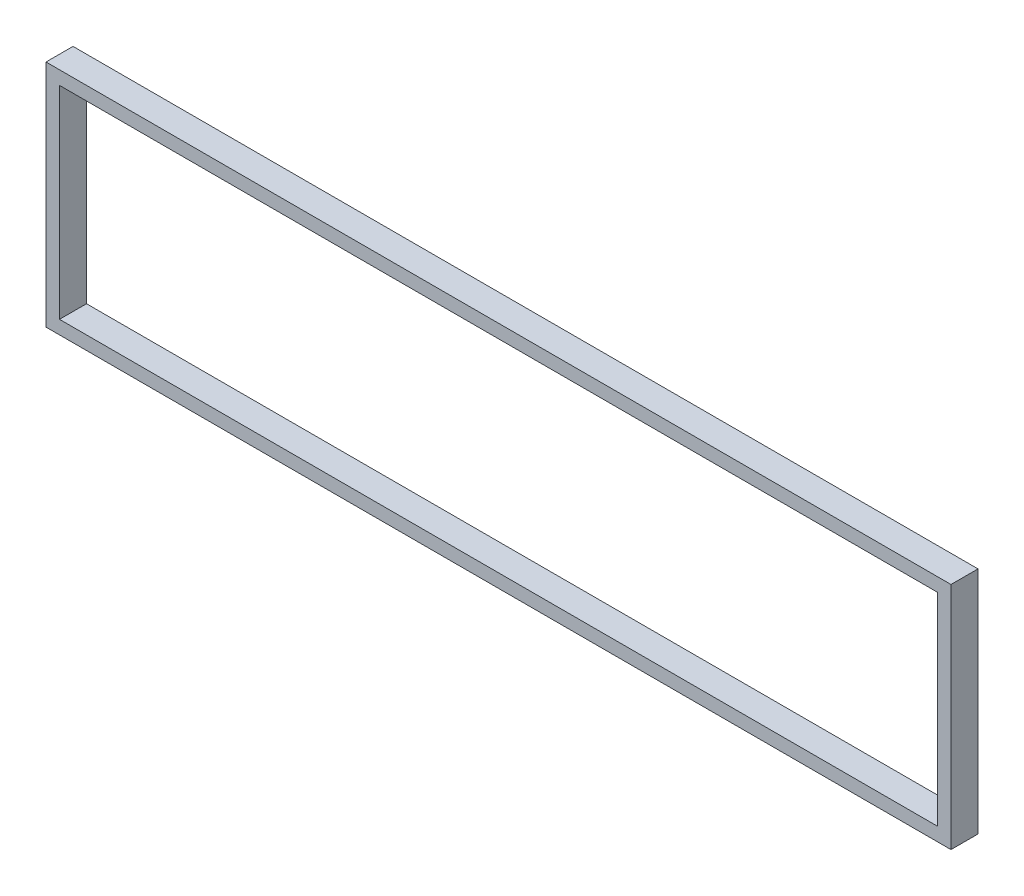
ISO-10303-21;
HEADER;
FILE_DESCRIPTION(('STEP AP214'),'2;1');
FILE_NAME('part.step','',(''),(''),'','','');
FILE_SCHEMA(('AUTOMOTIVE_DESIGN { 1 0 10303 214 1 1 1 1 }'));
ENDSEC;
DATA;
#1=APPLICATION_CONTEXT('core data for automotive mechanical design processes');
#2=APPLICATION_PROTOCOL_DEFINITION('international standard','automotive_design',2000,#1);
#3=PRODUCT_CONTEXT('',#1,'mechanical');
#4=PRODUCT('Part','Part','',(#3));
#5=PRODUCT_RELATED_PRODUCT_CATEGORY('part','',(#4));
#6=PRODUCT_DEFINITION_FORMATION('','',#4);
#7=PRODUCT_DEFINITION_CONTEXT('part definition',#1,'design');
#8=PRODUCT_DEFINITION('design','',#6,#7);
#9=PRODUCT_DEFINITION_SHAPE('','',#8);
#10=(LENGTH_UNIT() NAMED_UNIT(*) SI_UNIT(.MILLI.,.METRE.));
#11=(NAMED_UNIT(*) PLANE_ANGLE_UNIT() SI_UNIT($,.RADIAN.));
#12=(NAMED_UNIT(*) SI_UNIT($,.STERADIAN.) SOLID_ANGLE_UNIT());
#13=UNCERTAINTY_MEASURE_WITH_UNIT(LENGTH_MEASURE(1.E-05),#10,'distance_accuracy_value','');
#14=(GEOMETRIC_REPRESENTATION_CONTEXT(3) GLOBAL_UNCERTAINTY_ASSIGNED_CONTEXT((#13)) GLOBAL_UNIT_ASSIGNED_CONTEXT((#10,
#11,#12)) REPRESENTATION_CONTEXT('',''));
#15=CARTESIAN_POINT('',(0.,0.,0.));
#16=DIRECTION('',(0.,0.,1.));
#17=DIRECTION('',(1.,0.,0.));
#18=AXIS2_PLACEMENT_3D('',#15,#16,#17);
#19=CARTESIAN_POINT('',(-54509.9999999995,-10.0000000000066,10.));
#20=DIRECTION('',(0.,0.,1.));
#21=DIRECTION('',(1.,0.,0.));
#22=AXIS2_PLACEMENT_3D('',#19,#20,#21);
#23=PLANE('',#22);
#24=DIRECTION('',(0.,-1.,0.));
#25=VECTOR('',#24,1.);
#26=CARTESIAN_POINT('',(-54509.9999999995,159.999999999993,10.));
#27=LINE('',#26,#25);
#28=CARTESIAN_POINT('',(-54509.9999999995,159.999999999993,10.));
#29=VERTEX_POINT('',#28);
#30=CARTESIAN_POINT('',(-54509.9999999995,-10.0000000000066,10.));
#31=VERTEX_POINT('',#30);
#32=EDGE_CURVE('E137',#29,#31,#27,.T.);
#33=ORIENTED_EDGE('',*,*,#32,.T.);
#34=DIRECTION('',(1.,0.,0.));
#35=VECTOR('',#34,1.);
#36=CARTESIAN_POINT('',(-54509.9999999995,-10.0000000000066,10.));
#37=LINE('',#36,#35);
#38=CARTESIAN_POINT('',(-53839.9999999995,-10.0000000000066,10.));
#39=VERTEX_POINT('',#38);
#40=EDGE_CURVE('E140',#31,#39,#37,.T.);
#41=ORIENTED_EDGE('',*,*,#40,.T.);
#42=DIRECTION('',(0.,1.,0.));
#43=VECTOR('',#42,1.);
#44=CARTESIAN_POINT('',(-53839.9999999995,159.999999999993,10.));
#45=LINE('',#44,#43);
#46=CARTESIAN_POINT('',(-53839.9999999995,159.999999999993,10.));
#47=VERTEX_POINT('',#46);
#48=EDGE_CURVE('E143',#39,#47,#45,.T.);
#49=ORIENTED_EDGE('',*,*,#48,.T.);
#50=DIRECTION('',(-1.,0.,0.));
#51=VECTOR('',#50,1.);
#52=CARTESIAN_POINT('',(-54509.9999999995,159.999999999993,10.));
#53=LINE('',#52,#51);
#54=EDGE_CURVE('E145',#47,#29,#53,.T.);
#55=ORIENTED_EDGE('',*,*,#54,.T.);
#56=EDGE_LOOP('',(#33,#41,#49,#55));
#57=FACE_BOUND('',#56,.T.);
#58=DIRECTION('',(1.,0.,0.));
#59=VECTOR('',#58,1.);
#60=CARTESIAN_POINT('',(-54499.9999999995,-6.6373664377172E-12,10.));
#61=LINE('',#60,#59);
#62=CARTESIAN_POINT('',(-54499.9999999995,-6.6373664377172E-12,10.));
#63=VERTEX_POINT('',#62);
#64=CARTESIAN_POINT('',(-53849.9999999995,-6.6373664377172E-12,10.));
#65=VERTEX_POINT('',#64);
#66=EDGE_CURVE('E109',#63,#65,#61,.T.);
#67=ORIENTED_EDGE('',*,*,#66,.F.);
#68=DIRECTION('',(0.,-1.,0.));
#69=VECTOR('',#68,1.);
#70=CARTESIAN_POINT('',(-54499.9999999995,149.999999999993,10.));
#71=LINE('',#70,#69);
#72=CARTESIAN_POINT('',(-54499.9999999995,149.999999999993,10.));
#73=VERTEX_POINT('',#72);
#74=EDGE_CURVE('E101',#73,#63,#71,.T.);
#75=ORIENTED_EDGE('',*,*,#74,.F.);
#76=DIRECTION('',(-1.,0.,0.));
#77=VECTOR('',#76,1.);
#78=CARTESIAN_POINT('',(-54499.9999999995,149.999999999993,10.));
#79=LINE('',#78,#77);
#80=CARTESIAN_POINT('',(-53849.9999999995,149.999999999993,10.));
#81=VERTEX_POINT('',#80);
#82=EDGE_CURVE('E123',#81,#73,#79,.T.);
#83=ORIENTED_EDGE('',*,*,#82,.F.);
#84=DIRECTION('',(0.,1.,0.));
#85=VECTOR('',#84,1.);
#86=CARTESIAN_POINT('',(-53849.9999999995,149.999999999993,10.));
#87=LINE('',#86,#85);
#88=EDGE_CURVE('E121',#65,#81,#87,.T.);
#89=ORIENTED_EDGE('',*,*,#88,.F.);
#90=EDGE_LOOP('',(#67,#75,#83,#89));
#91=FACE_BOUND('',#90,.T.);
#92=ADVANCED_FACE('F36',(#57,#91),#23,.T.);
#93=CARTESIAN_POINT('',(-54509.9999999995,-10.0000000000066,-10.));
#94=DIRECTION('',(0.,0.,1.));
#95=DIRECTION('',(1.,0.,0.));
#96=AXIS2_PLACEMENT_3D('',#93,#94,#95);
#97=PLANE('',#96);
#98=DIRECTION('',(0.,-1.,0.));
#99=VECTOR('',#98,1.);
#100=CARTESIAN_POINT('',(-54509.9999999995,159.999999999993,-10.));
#101=LINE('',#100,#99);
#102=CARTESIAN_POINT('',(-54509.9999999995,159.999999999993,-10.));
#103=VERTEX_POINT('',#102);
#104=CARTESIAN_POINT('',(-54509.9999999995,-10.0000000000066,-10.));
#105=VERTEX_POINT('',#104);
#106=EDGE_CURVE('E117',#103,#105,#101,.T.);
#107=ORIENTED_EDGE('',*,*,#106,.F.);
#108=DIRECTION('',(-1.,0.,0.));
#109=VECTOR('',#108,1.);
#110=CARTESIAN_POINT('',(-54509.9999999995,159.999999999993,-10.));
#111=LINE('',#110,#109);
#112=CARTESIAN_POINT('',(-53839.9999999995,159.999999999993,-10.));
#113=VERTEX_POINT('',#112);
#114=EDGE_CURVE('E141',#113,#103,#111,.T.);
#115=ORIENTED_EDGE('',*,*,#114,.F.);
#116=DIRECTION('',(0.,1.,0.));
#117=VECTOR('',#116,1.);
#118=CARTESIAN_POINT('',(-53839.9999999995,159.999999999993,-10.));
#119=LINE('',#118,#117);
#120=CARTESIAN_POINT('',(-53839.9999999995,-10.0000000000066,-10.));
#121=VERTEX_POINT('',#120);
#122=EDGE_CURVE('E152',#121,#113,#119,.T.);
#123=ORIENTED_EDGE('',*,*,#122,.F.);
#124=DIRECTION('',(1.,0.,0.));
#125=VECTOR('',#124,1.);
#126=CARTESIAN_POINT('',(-54509.9999999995,-10.0000000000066,-10.));
#127=LINE('',#126,#125);
#128=EDGE_CURVE('E150',#105,#121,#127,.T.);
#129=ORIENTED_EDGE('',*,*,#128,.F.);
#130=EDGE_LOOP('',(#107,#115,#123,#129));
#131=FACE_BOUND('',#130,.T.);
#132=DIRECTION('',(0.,-1.,0.));
#133=VECTOR('',#132,1.);
#134=CARTESIAN_POINT('',(-54499.9999999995,149.999999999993,-10.));
#135=LINE('',#134,#133);
#136=CARTESIAN_POINT('',(-54499.9999999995,149.999999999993,-10.));
#137=VERTEX_POINT('',#136);
#138=CARTESIAN_POINT('',(-54499.9999999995,-6.6373664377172E-12,-10.));
#139=VERTEX_POINT('',#138);
#140=EDGE_CURVE('E59',#137,#139,#135,.T.);
#141=ORIENTED_EDGE('',*,*,#140,.T.);
#142=DIRECTION('',(1.,0.,0.));
#143=VECTOR('',#142,1.);
#144=CARTESIAN_POINT('',(-54499.9999999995,-6.6373664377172E-12,-10.));
#145=LINE('',#144,#143);
#146=CARTESIAN_POINT('',(-53849.9999999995,-6.6373664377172E-12,-10.));
#147=VERTEX_POINT('',#146);
#148=EDGE_CURVE('E116',#139,#147,#145,.T.);
#149=ORIENTED_EDGE('',*,*,#148,.T.);
#150=DIRECTION('',(0.,1.,0.));
#151=VECTOR('',#150,1.);
#152=CARTESIAN_POINT('',(-53849.9999999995,149.999999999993,-10.));
#153=LINE('',#152,#151);
#154=CARTESIAN_POINT('',(-53849.9999999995,149.999999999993,-10.));
#155=VERTEX_POINT('',#154);
#156=EDGE_CURVE('E129',#147,#155,#153,.T.);
#157=ORIENTED_EDGE('',*,*,#156,.T.);
#158=DIRECTION('',(-1.,0.,0.));
#159=VECTOR('',#158,1.);
#160=CARTESIAN_POINT('',(-54499.9999999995,149.999999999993,-10.));
#161=LINE('',#160,#159);
#162=EDGE_CURVE('E110',#155,#137,#161,.T.);
#163=ORIENTED_EDGE('',*,*,#162,.T.);
#164=EDGE_LOOP('',(#141,#149,#157,#163));
#165=FACE_BOUND('',#164,.T.);
#166=ADVANCED_FACE('F170',(#131,#165),#97,.F.);
#167=CARTESIAN_POINT('',(-54509.9999999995,159.999999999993,10.));
#168=DIRECTION('',(1.,0.,0.));
#169=DIRECTION('',(0.,0.,-1.));
#170=AXIS2_PLACEMENT_3D('',#167,#168,#169);
#171=PLANE('',#170);
#172=ORIENTED_EDGE('',*,*,#106,.T.);
#173=DIRECTION('',(0.,0.,-1.));
#174=VECTOR('',#173,1.);
#175=CARTESIAN_POINT('',(-54509.9999999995,-10.0000000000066,10.));
#176=LINE('',#175,#174);
#177=EDGE_CURVE('E11',#31,#105,#176,.T.);
#178=ORIENTED_EDGE('',*,*,#177,.F.);
#179=ORIENTED_EDGE('',*,*,#32,.F.);
#180=DIRECTION('',(0.,0.,-1.));
#181=VECTOR('',#180,1.);
#182=CARTESIAN_POINT('',(-54509.9999999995,159.999999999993,10.));
#183=LINE('',#182,#181);
#184=EDGE_CURVE('E147',#29,#103,#183,.T.);
#185=ORIENTED_EDGE('',*,*,#184,.T.);
#186=EDGE_LOOP('',(#172,#178,#179,#185));
#187=FACE_BOUND('',#186,.T.);
#188=ADVANCED_FACE('F38',(#187),#171,.F.);
#189=CARTESIAN_POINT('',(-54509.9999999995,-10.0000000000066,10.));
#190=DIRECTION('',(0.,1.,0.));
#191=DIRECTION('',(0.,0.,1.));
#192=AXIS2_PLACEMENT_3D('',#189,#190,#191);
#193=PLANE('',#192);
#194=ORIENTED_EDGE('',*,*,#128,.T.);
#195=DIRECTION('',(0.,0.,-1.));
#196=VECTOR('',#195,1.);
#197=CARTESIAN_POINT('',(-53839.9999999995,-10.0000000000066,10.));
#198=LINE('',#197,#196);
#199=EDGE_CURVE('E44',#39,#121,#198,.T.);
#200=ORIENTED_EDGE('',*,*,#199,.F.);
#201=ORIENTED_EDGE('',*,*,#40,.F.);
#202=ORIENTED_EDGE('',*,*,#177,.T.);
#203=EDGE_LOOP('',(#194,#200,#201,#202));
#204=FACE_BOUND('',#203,.T.);
#205=ADVANCED_FACE('F180',(#204),#193,.F.);
#206=CARTESIAN_POINT('',(-53839.9999999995,159.999999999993,10.));
#207=DIRECTION('',(-1.,0.,0.));
#208=DIRECTION('',(0.,-1.,0.));
#209=AXIS2_PLACEMENT_3D('',#206,#207,#208);
#210=PLANE('',#209);
#211=ORIENTED_EDGE('',*,*,#122,.T.);
#212=DIRECTION('',(0.,0.,-1.));
#213=VECTOR('',#212,1.);
#214=CARTESIAN_POINT('',(-53839.9999999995,159.999999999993,10.));
#215=LINE('',#214,#213);
#216=EDGE_CURVE('E157',#47,#113,#215,.T.);
#217=ORIENTED_EDGE('',*,*,#216,.F.);
#218=ORIENTED_EDGE('',*,*,#48,.F.);
#219=ORIENTED_EDGE('',*,*,#199,.T.);
#220=EDGE_LOOP('',(#211,#217,#218,#219));
#221=FACE_BOUND('',#220,.T.);
#222=ADVANCED_FACE('F164',(#221),#210,.F.);
#223=CARTESIAN_POINT('',(-54509.9999999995,159.999999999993,10.));
#224=DIRECTION('',(0.,-1.,0.));
#225=DIRECTION('',(0.,0.,-1.));
#226=AXIS2_PLACEMENT_3D('',#223,#224,#225);
#227=PLANE('',#226);
#228=ORIENTED_EDGE('',*,*,#114,.T.);
#229=ORIENTED_EDGE('',*,*,#184,.F.);
#230=ORIENTED_EDGE('',*,*,#54,.F.);
#231=ORIENTED_EDGE('',*,*,#216,.T.);
#232=EDGE_LOOP('',(#228,#229,#230,#231));
#233=FACE_BOUND('',#232,.T.);
#234=ADVANCED_FACE('F174',(#233),#227,.F.);
#235=CARTESIAN_POINT('',(-54499.9999999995,149.999999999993,10.));
#236=DIRECTION('',(1.,0.,0.));
#237=DIRECTION('',(0.,1.,0.));
#238=AXIS2_PLACEMENT_3D('',#235,#236,#237);
#239=PLANE('',#238);
#240=ORIENTED_EDGE('',*,*,#140,.F.);
#241=DIRECTION('',(0.,0.,-1.));
#242=VECTOR('',#241,1.);
#243=CARTESIAN_POINT('',(-54499.9999999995,149.999999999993,10.));
#244=LINE('',#243,#242);
#245=EDGE_CURVE('E105',#73,#137,#244,.T.);
#246=ORIENTED_EDGE('',*,*,#245,.F.);
#247=ORIENTED_EDGE('',*,*,#74,.T.);
#248=DIRECTION('',(0.,0.,-1.));
#249=VECTOR('',#248,1.);
#250=CARTESIAN_POINT('',(-54499.9999999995,-6.6373664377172E-12,10.));
#251=LINE('',#250,#249);
#252=EDGE_CURVE('E104',#63,#139,#251,.T.);
#253=ORIENTED_EDGE('',*,*,#252,.T.);
#254=EDGE_LOOP('',(#240,#246,#247,#253));
#255=FACE_BOUND('',#254,.T.);
#256=ADVANCED_FACE('F103',(#255),#239,.T.);
#257=CARTESIAN_POINT('',(-54499.9999999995,-6.6373664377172E-12,10.));
#258=DIRECTION('',(0.,1.,0.));
#259=DIRECTION('',(0.,0.,1.));
#260=AXIS2_PLACEMENT_3D('',#257,#258,#259);
#261=PLANE('',#260);
#262=ORIENTED_EDGE('',*,*,#148,.F.);
#263=ORIENTED_EDGE('',*,*,#252,.F.);
#264=ORIENTED_EDGE('',*,*,#66,.T.);
#265=DIRECTION('',(0.,0.,-1.));
#266=VECTOR('',#265,1.);
#267=CARTESIAN_POINT('',(-53849.9999999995,-6.6373664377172E-12,10.));
#268=LINE('',#267,#266);
#269=EDGE_CURVE('E118',#65,#147,#268,.T.);
#270=ORIENTED_EDGE('',*,*,#269,.T.);
#271=EDGE_LOOP('',(#262,#263,#264,#270));
#272=FACE_BOUND('',#271,.T.);
#273=ADVANCED_FACE('F113',(#272),#261,.T.);
#274=CARTESIAN_POINT('',(-53849.9999999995,149.999999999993,10.));
#275=DIRECTION('',(-1.,0.,0.));
#276=DIRECTION('',(0.,0.,1.));
#277=AXIS2_PLACEMENT_3D('',#274,#275,#276);
#278=PLANE('',#277);
#279=ORIENTED_EDGE('',*,*,#156,.F.);
#280=ORIENTED_EDGE('',*,*,#269,.F.);
#281=ORIENTED_EDGE('',*,*,#88,.T.);
#282=DIRECTION('',(0.,0.,-1.));
#283=VECTOR('',#282,1.);
#284=CARTESIAN_POINT('',(-53849.9999999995,149.999999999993,10.));
#285=LINE('',#284,#283);
#286=EDGE_CURVE('E51',#81,#155,#285,.T.);
#287=ORIENTED_EDGE('',*,*,#286,.T.);
#288=EDGE_LOOP('',(#279,#280,#281,#287));
#289=FACE_BOUND('',#288,.T.);
#290=ADVANCED_FACE('F203',(#289),#278,.T.);
#291=CARTESIAN_POINT('',(-54499.9999999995,149.999999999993,10.));
#292=DIRECTION('',(0.,-1.,0.));
#293=DIRECTION('',(0.,0.,-1.));
#294=AXIS2_PLACEMENT_3D('',#291,#292,#293);
#295=PLANE('',#294);
#296=ORIENTED_EDGE('',*,*,#162,.F.);
#297=ORIENTED_EDGE('',*,*,#286,.F.);
#298=ORIENTED_EDGE('',*,*,#82,.T.);
#299=ORIENTED_EDGE('',*,*,#245,.T.);
#300=EDGE_LOOP('',(#296,#297,#298,#299));
#301=FACE_BOUND('',#300,.T.);
#302=ADVANCED_FACE('F207',(#301),#295,.T.);
#303=CLOSED_SHELL('',(#92,#166,#188,#205,#222,#234,#256,#273,#290,#302));
#304=MANIFOLD_SOLID_BREP('B2',#303);
#305=ADVANCED_BREP_SHAPE_REPRESENTATION('',(#18,#304),#14);
#306=SHAPE_DEFINITION_REPRESENTATION(#9,#305);
ENDSEC;
END-ISO-10303-21;
